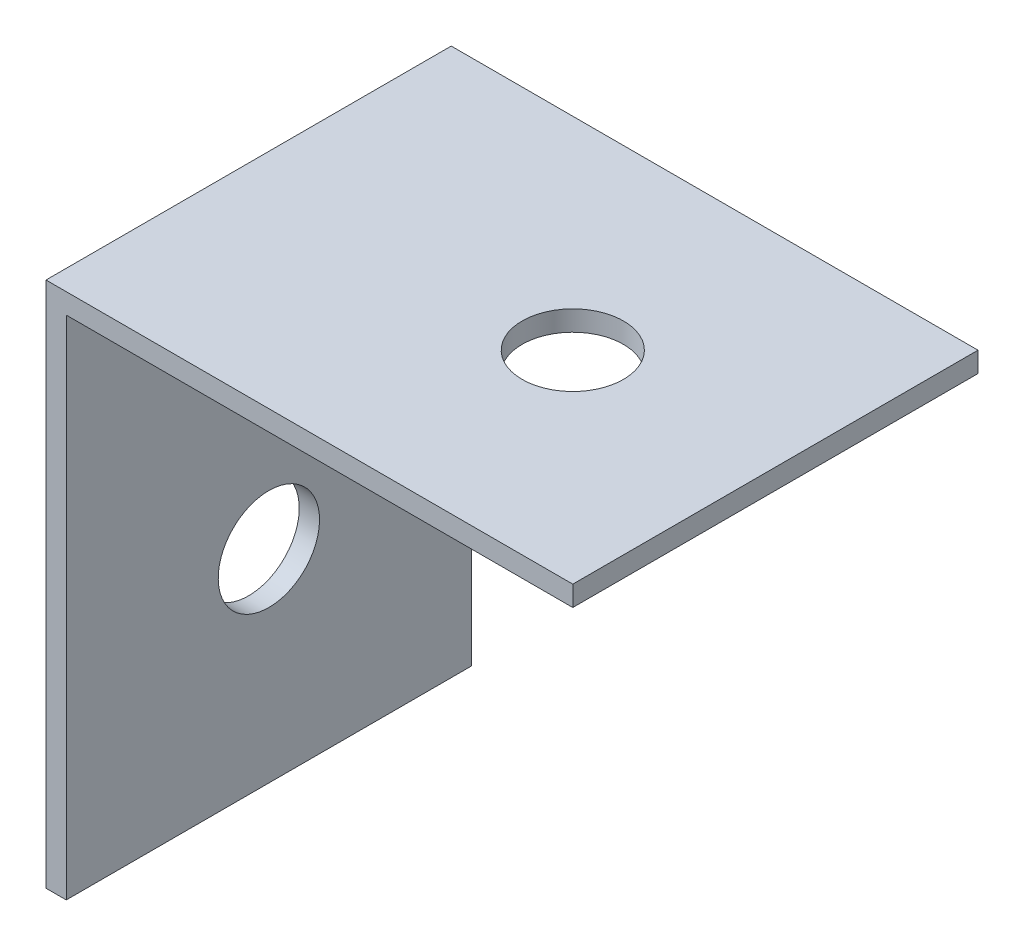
from build123d import *

# Parameters (mm, degrees)
EXTRUDE_THIN1_DEPTH      = 10
EXTRUDE_THIN1_DEPTH_BACK = 10
CUT_H_L_1_REACH          = 39.43
SKETCH2_R                = 2.5
CUT_H_L_2_REACH          = 38.742
SKETCH3_R                = 2.5


with BuildPart() as part:
    # Sketch1 → Extrude-Thin1 (new, two sides: drawn at the far end of the back side and taken through both)
    with BuildSketch(Plane.XY.offset(-EXTRUDE_THIN1_DEPTH_BACK)):
        Polygon((0, -25), (0, 0), (25, 0), (25, 1), (-1, 1), (-1, -25), align=None)
    extrude(amount=EXTRUDE_THIN1_DEPTH + EXTRUDE_THIN1_DEPTH_BACK)

    # Sketch2 → Cut h_l 1 (cut, up to next)
    with BuildSketch(Plane(origin=(0, 1, 0), x_dir=(-1, 0, 0), z_dir=(0, 1, 0)), mode=Mode.PRIVATE) as cut_h_l_1_sk1:
        with Locations(Location((-15, 0, 0), (0, 0, 90))):
            Circle(SKETCH2_R)
    cut_h_l_1_tool1 = extrude(cut_h_l_1_sk1.sketch, amount=-CUT_H_L_1_REACH, mode=Mode.PRIVATE) & part.part
    add(cut_h_l_1_tool1.solids().sort_by_distance((15, 1, 0))[0], mode=Mode.SUBTRACT)

    # Sketch3 → Cut h_l 2 (cut, up to next)
    with BuildSketch(Plane(origin=(0, 0, 0), x_dir=(0, 0, -1), z_dir=(1, 0, 0)), mode=Mode.PRIVATE) as cut_h_l_2_sk1:
        with Locations(Location((0, -15, 0), (0, 0, 90))):
            Circle(SKETCH3_R)
    cut_h_l_2_tool1 = extrude(cut_h_l_2_sk1.sketch, amount=-CUT_H_L_2_REACH, mode=Mode.PRIVATE) & part.part
    add(cut_h_l_2_tool1.solids().sort_by_distance((0, -15, 0))[0], mode=Mode.SUBTRACT)


solid = part.part
